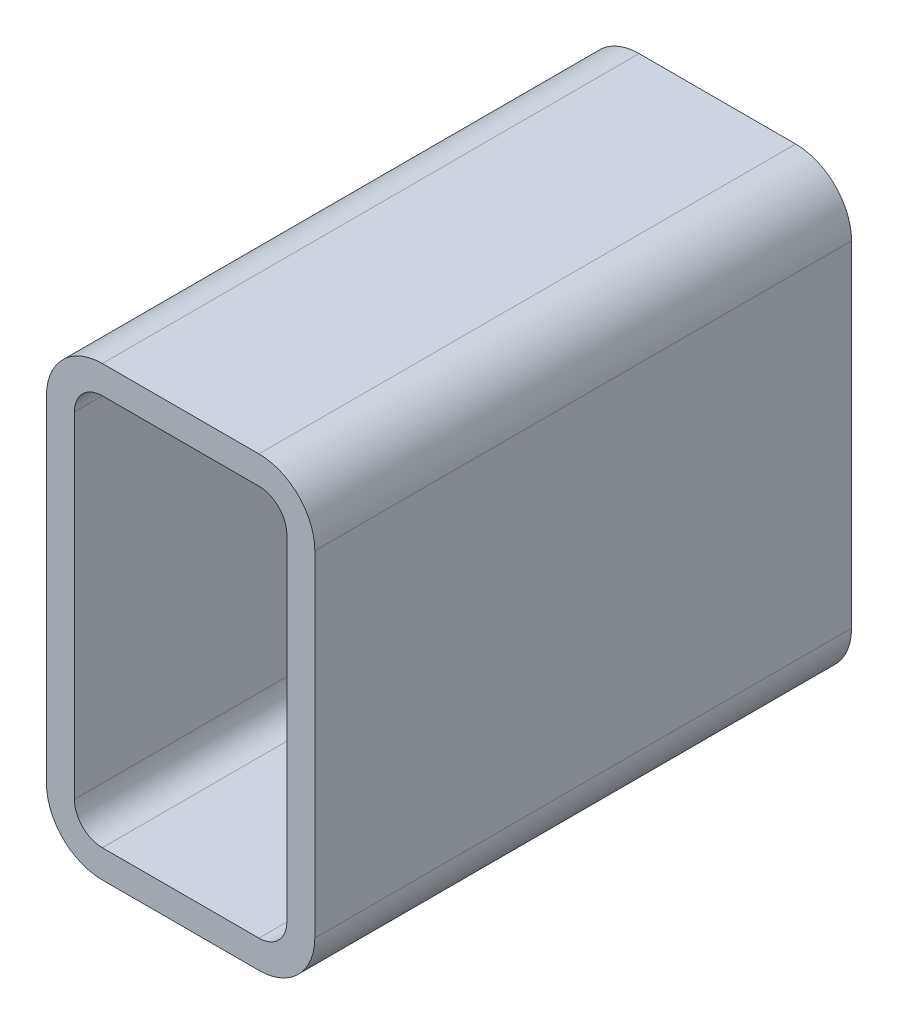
ISO-10303-21;
HEADER;
FILE_DESCRIPTION(('STEP AP214'),'2;1');
FILE_NAME('part.step','',(''),(''),'','','');
FILE_SCHEMA(('AUTOMOTIVE_DESIGN { 1 0 10303 214 1 1 1 1 }'));
ENDSEC;
DATA;
#1=APPLICATION_CONTEXT('core data for automotive mechanical design processes');
#2=APPLICATION_PROTOCOL_DEFINITION('international standard','automotive_design',2000,#1);
#3=PRODUCT_CONTEXT('',#1,'mechanical');
#4=PRODUCT('Part','Part','',(#3));
#5=PRODUCT_RELATED_PRODUCT_CATEGORY('part','',(#4));
#6=PRODUCT_DEFINITION_FORMATION('','',#4);
#7=PRODUCT_DEFINITION_CONTEXT('part definition',#1,'design');
#8=PRODUCT_DEFINITION('design','',#6,#7);
#9=PRODUCT_DEFINITION_SHAPE('','',#8);
#10=(LENGTH_UNIT() NAMED_UNIT(*) SI_UNIT(.MILLI.,.METRE.));
#11=(NAMED_UNIT(*) PLANE_ANGLE_UNIT() SI_UNIT($,.RADIAN.));
#12=(NAMED_UNIT(*) SI_UNIT($,.STERADIAN.) SOLID_ANGLE_UNIT());
#13=UNCERTAINTY_MEASURE_WITH_UNIT(LENGTH_MEASURE(1.E-05),#10,'distance_accuracy_value','');
#14=(GEOMETRIC_REPRESENTATION_CONTEXT(3) GLOBAL_UNCERTAINTY_ASSIGNED_CONTEXT((#13)) GLOBAL_UNIT_ASSIGNED_CONTEXT((#10,
#11,#12)) REPRESENTATION_CONTEXT('',''));
#15=CARTESIAN_POINT('',(0.,0.,0.));
#16=DIRECTION('',(0.,0.,1.));
#17=DIRECTION('',(1.,0.,0.));
#18=AXIS2_PLACEMENT_3D('',#15,#16,#17);
#19=CARTESIAN_POINT('',(31.7973013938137,224.170313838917,304.8));
#20=DIRECTION('',(0.,0.,1.));
#21=DIRECTION('',(1.,0.,0.));
#22=AXIS2_PLACEMENT_3D('',#19,#20,#21);
#23=PLANE('',#22);
#24=CARTESIAN_POINT('',(31.7973013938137,224.170313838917,304.8));
#25=DIRECTION('',(0.,0.,1.));
#26=DIRECTION('',(1.,0.,0.));
#27=AXIS2_PLACEMENT_3D('',#24,#25,#26);
#28=CIRCLE('',#27,31.75);
#29=CARTESIAN_POINT('',(31.7973013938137,255.920313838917,304.8));
#30=VERTEX_POINT('',#29);
#31=CARTESIAN_POINT('',(0.0473013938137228,224.170313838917,304.8));
#32=VERTEX_POINT('',#31);
#33=EDGE_CURVE('E211',#30,#32,#28,.T.);
#34=ORIENTED_EDGE('',*,*,#33,.T.);
#35=DIRECTION('',(0.,-1.,0.));
#36=VECTOR('',#35,1.);
#37=CARTESIAN_POINT('',(0.0473013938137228,33.6703138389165,304.8));
#38=LINE('',#37,#36);
#39=CARTESIAN_POINT('',(0.0473013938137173,33.6703138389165,304.8));
#40=VERTEX_POINT('',#39);
#41=EDGE_CURVE('E214',#32,#40,#38,.T.);
#42=ORIENTED_EDGE('',*,*,#41,.T.);
#43=CARTESIAN_POINT('',(31.7973013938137,33.6703138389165,304.8));
#44=DIRECTION('',(0.,0.,1.));
#45=DIRECTION('',(1.,0.,0.));
#46=AXIS2_PLACEMENT_3D('',#43,#44,#45);
#47=CIRCLE('',#46,31.75);
#48=CARTESIAN_POINT('',(31.7973013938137,1.92031383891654,304.8));
#49=VERTEX_POINT('',#48);
#50=EDGE_CURVE('E217',#40,#49,#47,.T.);
#51=ORIENTED_EDGE('',*,*,#50,.T.);
#52=DIRECTION('',(1.,0.,0.));
#53=VECTOR('',#52,1.);
#54=CARTESIAN_POINT('',(120.697301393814,1.92031383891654,304.8));
#55=LINE('',#54,#53);
#56=CARTESIAN_POINT('',(120.697301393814,1.92031383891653,304.8));
#57=VERTEX_POINT('',#56);
#58=EDGE_CURVE('E219',#49,#57,#55,.T.);
#59=ORIENTED_EDGE('',*,*,#58,.T.);
#60=CARTESIAN_POINT('',(120.697301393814,33.6703138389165,304.8));
#61=DIRECTION('',(0.,0.,1.));
#62=DIRECTION('',(1.,0.,0.));
#63=AXIS2_PLACEMENT_3D('',#60,#61,#62);
#64=CIRCLE('',#63,31.75);
#65=CARTESIAN_POINT('',(152.447301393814,33.6703138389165,304.8));
#66=VERTEX_POINT('',#65);
#67=EDGE_CURVE('E221',#57,#66,#64,.T.);
#68=ORIENTED_EDGE('',*,*,#67,.T.);
#69=DIRECTION('',(0.,1.,0.));
#70=VECTOR('',#69,1.);
#71=CARTESIAN_POINT('',(152.447301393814,224.170313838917,304.8));
#72=LINE('',#71,#70);
#73=CARTESIAN_POINT('',(152.447301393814,224.170313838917,304.8));
#74=VERTEX_POINT('',#73);
#75=EDGE_CURVE('E223',#66,#74,#72,.T.);
#76=ORIENTED_EDGE('',*,*,#75,.T.);
#77=CARTESIAN_POINT('',(120.697301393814,224.170313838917,304.8));
#78=DIRECTION('',(0.,0.,1.));
#79=DIRECTION('',(1.,0.,0.));
#80=AXIS2_PLACEMENT_3D('',#77,#78,#79);
#81=CIRCLE('',#80,31.75);
#82=CARTESIAN_POINT('',(120.697301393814,255.920313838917,304.8));
#83=VERTEX_POINT('',#82);
#84=EDGE_CURVE('E225',#74,#83,#81,.T.);
#85=ORIENTED_EDGE('',*,*,#84,.T.);
#86=DIRECTION('',(-1.,0.,0.));
#87=VECTOR('',#86,1.);
#88=CARTESIAN_POINT('',(31.7973013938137,255.920313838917,304.8));
#89=LINE('',#88,#87);
#90=EDGE_CURVE('E227',#83,#30,#89,.T.);
#91=ORIENTED_EDGE('',*,*,#90,.T.);
#92=EDGE_LOOP('',(#34,#42,#51,#59,#68,#76,#85,#91));
#93=FACE_BOUND('',#92,.T.);
#94=DIRECTION('',(0.,-1.,0.));
#95=VECTOR('',#94,1.);
#96=CARTESIAN_POINT('',(15.9223013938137,33.6703138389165,304.8));
#97=LINE('',#96,#95);
#98=CARTESIAN_POINT('',(15.9223013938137,224.170313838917,304.8));
#99=VERTEX_POINT('',#98);
#100=CARTESIAN_POINT('',(15.9223013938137,33.6703138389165,304.8));
#101=VERTEX_POINT('',#100);
#102=EDGE_CURVE('E154',#99,#101,#97,.T.);
#103=ORIENTED_EDGE('',*,*,#102,.F.);
#104=CARTESIAN_POINT('',(31.7973013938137,224.170313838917,304.8));
#105=DIRECTION('',(0.,0.,1.));
#106=DIRECTION('',(1.,0.,0.));
#107=AXIS2_PLACEMENT_3D('',#104,#105,#106);
#108=CIRCLE('',#107,15.875);
#109=CARTESIAN_POINT('',(31.7973013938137,240.045313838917,304.8));
#110=VERTEX_POINT('',#109);
#111=EDGE_CURVE('E146',#110,#99,#108,.T.);
#112=ORIENTED_EDGE('',*,*,#111,.F.);
#113=DIRECTION('',(-1.,0.,0.));
#114=VECTOR('',#113,1.);
#115=CARTESIAN_POINT('',(31.7973013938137,240.045313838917,304.8));
#116=LINE('',#115,#114);
#117=CARTESIAN_POINT('',(120.697301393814,240.045313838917,304.8));
#118=VERTEX_POINT('',#117);
#119=EDGE_CURVE('E179',#118,#110,#116,.T.);
#120=ORIENTED_EDGE('',*,*,#119,.F.);
#121=CARTESIAN_POINT('',(120.697301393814,224.170313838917,304.8));
#122=DIRECTION('',(0.,0.,1.));
#123=DIRECTION('',(1.,0.,0.));
#124=AXIS2_PLACEMENT_3D('',#121,#122,#123);
#125=CIRCLE('',#124,15.875);
#126=CARTESIAN_POINT('',(136.572301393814,224.170313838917,304.8));
#127=VERTEX_POINT('',#126);
#128=EDGE_CURVE('E177',#127,#118,#125,.T.);
#129=ORIENTED_EDGE('',*,*,#128,.F.);
#130=DIRECTION('',(0.,1.,0.));
#131=VECTOR('',#130,1.);
#132=CARTESIAN_POINT('',(136.572301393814,224.170313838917,304.8));
#133=LINE('',#132,#131);
#134=CARTESIAN_POINT('',(136.572301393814,33.6703138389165,304.8));
#135=VERTEX_POINT('',#134);
#136=EDGE_CURVE('E175',#135,#127,#133,.T.);
#137=ORIENTED_EDGE('',*,*,#136,.F.);
#138=CARTESIAN_POINT('',(120.697301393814,33.6703138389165,304.8));
#139=DIRECTION('',(0.,0.,1.));
#140=DIRECTION('',(1.,0.,0.));
#141=AXIS2_PLACEMENT_3D('',#138,#139,#140);
#142=CIRCLE('',#141,15.875);
#143=CARTESIAN_POINT('',(120.697301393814,17.7953138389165,304.8));
#144=VERTEX_POINT('',#143);
#145=EDGE_CURVE('E173',#144,#135,#142,.T.);
#146=ORIENTED_EDGE('',*,*,#145,.F.);
#147=DIRECTION('',(1.,0.,0.));
#148=VECTOR('',#147,1.);
#149=CARTESIAN_POINT('',(120.697301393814,17.7953138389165,304.8));
#150=LINE('',#149,#148);
#151=CARTESIAN_POINT('',(31.7973013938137,17.7953138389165,304.8));
#152=VERTEX_POINT('',#151);
#153=EDGE_CURVE('E169',#152,#144,#150,.T.);
#154=ORIENTED_EDGE('',*,*,#153,.F.);
#155=CARTESIAN_POINT('',(31.7973013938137,33.6703138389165,304.8));
#156=DIRECTION('',(0.,0.,1.));
#157=DIRECTION('',(1.,0.,0.));
#158=AXIS2_PLACEMENT_3D('',#155,#156,#157);
#159=CIRCLE('',#158,15.875);
#160=EDGE_CURVE('E167',#101,#152,#159,.T.);
#161=ORIENTED_EDGE('',*,*,#160,.F.);
#162=EDGE_LOOP('',(#103,#112,#120,#129,#137,#146,#154,#161));
#163=FACE_BOUND('',#162,.T.);
#164=ADVANCED_FACE('F33',(#93,#163),#23,.T.);
#165=CARTESIAN_POINT('',(31.7973013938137,224.170313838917,0.));
#166=DIRECTION('',(0.,0.,1.));
#167=DIRECTION('',(1.,0.,0.));
#168=AXIS2_PLACEMENT_3D('',#165,#166,#167);
#169=PLANE('',#168);
#170=CARTESIAN_POINT('',(31.7973013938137,224.170313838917,0.));
#171=DIRECTION('',(0.,0.,1.));
#172=DIRECTION('',(1.,0.,0.));
#173=AXIS2_PLACEMENT_3D('',#170,#171,#172);
#174=CIRCLE('',#173,31.75);
#175=CARTESIAN_POINT('',(31.7973013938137,255.920313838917,0.));
#176=VERTEX_POINT('',#175);
#177=CARTESIAN_POINT('',(0.0473013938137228,224.170313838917,0.));
#178=VERTEX_POINT('',#177);
#179=EDGE_CURVE('E162',#176,#178,#174,.T.);
#180=ORIENTED_EDGE('',*,*,#179,.F.);
#181=DIRECTION('',(-1.,0.,0.));
#182=VECTOR('',#181,1.);
#183=CARTESIAN_POINT('',(31.7973013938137,255.920313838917,0.));
#184=LINE('',#183,#182);
#185=CARTESIAN_POINT('',(120.697301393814,255.920313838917,0.));
#186=VERTEX_POINT('',#185);
#187=EDGE_CURVE('E215',#186,#176,#184,.T.);
#188=ORIENTED_EDGE('',*,*,#187,.F.);
#189=CARTESIAN_POINT('',(120.697301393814,224.170313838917,0.));
#190=DIRECTION('',(0.,0.,1.));
#191=DIRECTION('',(1.,0.,0.));
#192=AXIS2_PLACEMENT_3D('',#189,#190,#191);
#193=CIRCLE('',#192,31.75);
#194=CARTESIAN_POINT('',(152.447301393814,224.170313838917,0.));
#195=VERTEX_POINT('',#194);
#196=EDGE_CURVE('E242',#195,#186,#193,.T.);
#197=ORIENTED_EDGE('',*,*,#196,.F.);
#198=DIRECTION('',(0.,1.,0.));
#199=VECTOR('',#198,1.);
#200=CARTESIAN_POINT('',(152.447301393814,224.170313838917,0.));
#201=LINE('',#200,#199);
#202=CARTESIAN_POINT('',(152.447301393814,33.6703138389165,0.));
#203=VERTEX_POINT('',#202);
#204=EDGE_CURVE('E240',#203,#195,#201,.T.);
#205=ORIENTED_EDGE('',*,*,#204,.F.);
#206=CARTESIAN_POINT('',(120.697301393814,33.6703138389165,0.));
#207=DIRECTION('',(0.,0.,1.));
#208=DIRECTION('',(1.,0.,0.));
#209=AXIS2_PLACEMENT_3D('',#206,#207,#208);
#210=CIRCLE('',#209,31.75);
#211=CARTESIAN_POINT('',(120.697301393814,1.92031383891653,0.));
#212=VERTEX_POINT('',#211);
#213=EDGE_CURVE('E238',#212,#203,#210,.T.);
#214=ORIENTED_EDGE('',*,*,#213,.F.);
#215=DIRECTION('',(1.,0.,0.));
#216=VECTOR('',#215,1.);
#217=CARTESIAN_POINT('',(120.697301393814,1.92031383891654,0.));
#218=LINE('',#217,#216);
#219=CARTESIAN_POINT('',(31.7973013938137,1.92031383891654,0.));
#220=VERTEX_POINT('',#219);
#221=EDGE_CURVE('E236',#220,#212,#218,.T.);
#222=ORIENTED_EDGE('',*,*,#221,.F.);
#223=CARTESIAN_POINT('',(31.7973013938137,33.6703138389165,0.));
#224=DIRECTION('',(0.,0.,1.));
#225=DIRECTION('',(1.,0.,0.));
#226=AXIS2_PLACEMENT_3D('',#223,#224,#225);
#227=CIRCLE('',#226,31.75);
#228=CARTESIAN_POINT('',(0.0473013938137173,33.6703138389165,0.));
#229=VERTEX_POINT('',#228);
#230=EDGE_CURVE('E234',#229,#220,#227,.T.);
#231=ORIENTED_EDGE('',*,*,#230,.F.);
#232=DIRECTION('',(0.,-1.,0.));
#233=VECTOR('',#232,1.);
#234=CARTESIAN_POINT('',(0.0473013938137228,33.6703138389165,0.));
#235=LINE('',#234,#233);
#236=EDGE_CURVE('E232',#178,#229,#235,.T.);
#237=ORIENTED_EDGE('',*,*,#236,.F.);
#238=EDGE_LOOP('',(#180,#188,#197,#205,#214,#222,#231,#237));
#239=FACE_BOUND('',#238,.T.);
#240=CARTESIAN_POINT('',(31.7973013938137,224.170313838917,0.));
#241=DIRECTION('',(0.,0.,1.));
#242=DIRECTION('',(1.,0.,0.));
#243=AXIS2_PLACEMENT_3D('',#240,#241,#242);
#244=CIRCLE('',#243,15.875);
#245=CARTESIAN_POINT('',(31.7973013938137,240.045313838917,0.));
#246=VERTEX_POINT('',#245);
#247=CARTESIAN_POINT('',(15.9223013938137,224.170313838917,0.));
#248=VERTEX_POINT('',#247);
#249=EDGE_CURVE('E56',#246,#248,#244,.T.);
#250=ORIENTED_EDGE('',*,*,#249,.T.);
#251=DIRECTION('',(0.,-1.,0.));
#252=VECTOR('',#251,1.);
#253=CARTESIAN_POINT('',(15.9223013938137,33.6703138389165,0.));
#254=LINE('',#253,#252);
#255=CARTESIAN_POINT('',(15.9223013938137,33.6703138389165,0.));
#256=VERTEX_POINT('',#255);
#257=EDGE_CURVE('E161',#248,#256,#254,.T.);
#258=ORIENTED_EDGE('',*,*,#257,.T.);
#259=CARTESIAN_POINT('',(31.7973013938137,33.6703138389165,0.));
#260=DIRECTION('',(0.,0.,1.));
#261=DIRECTION('',(1.,0.,0.));
#262=AXIS2_PLACEMENT_3D('',#259,#260,#261);
#263=CIRCLE('',#262,15.875);
#264=CARTESIAN_POINT('',(31.7973013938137,17.7953138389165,0.));
#265=VERTEX_POINT('',#264);
#266=EDGE_CURVE('E183',#256,#265,#263,.T.);
#267=ORIENTED_EDGE('',*,*,#266,.T.);
#268=DIRECTION('',(1.,0.,0.));
#269=VECTOR('',#268,1.);
#270=CARTESIAN_POINT('',(120.697301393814,17.7953138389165,0.));
#271=LINE('',#270,#269);
#272=CARTESIAN_POINT('',(120.697301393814,17.7953138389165,0.));
#273=VERTEX_POINT('',#272);
#274=EDGE_CURVE('E186',#265,#273,#271,.T.);
#275=ORIENTED_EDGE('',*,*,#274,.T.);
#276=CARTESIAN_POINT('',(120.697301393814,33.6703138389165,0.));
#277=DIRECTION('',(0.,0.,1.));
#278=DIRECTION('',(1.,0.,0.));
#279=AXIS2_PLACEMENT_3D('',#276,#277,#278);
#280=CIRCLE('',#279,15.875);
#281=CARTESIAN_POINT('',(136.572301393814,33.6703138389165,0.));
#282=VERTEX_POINT('',#281);
#283=EDGE_CURVE('E189',#273,#282,#280,.T.);
#284=ORIENTED_EDGE('',*,*,#283,.T.);
#285=DIRECTION('',(0.,1.,0.));
#286=VECTOR('',#285,1.);
#287=CARTESIAN_POINT('',(136.572301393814,224.170313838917,0.));
#288=LINE('',#287,#286);
#289=CARTESIAN_POINT('',(136.572301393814,224.170313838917,0.));
#290=VERTEX_POINT('',#289);
#291=EDGE_CURVE('E192',#282,#290,#288,.T.);
#292=ORIENTED_EDGE('',*,*,#291,.T.);
#293=CARTESIAN_POINT('',(120.697301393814,224.170313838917,0.));
#294=DIRECTION('',(0.,0.,1.));
#295=DIRECTION('',(1.,0.,0.));
#296=AXIS2_PLACEMENT_3D('',#293,#294,#295);
#297=CIRCLE('',#296,15.875);
#298=CARTESIAN_POINT('',(120.697301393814,240.045313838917,0.));
#299=VERTEX_POINT('',#298);
#300=EDGE_CURVE('E195',#290,#299,#297,.T.);
#301=ORIENTED_EDGE('',*,*,#300,.T.);
#302=DIRECTION('',(-1.,0.,0.));
#303=VECTOR('',#302,1.);
#304=CARTESIAN_POINT('',(31.7973013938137,240.045313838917,0.));
#305=LINE('',#304,#303);
#306=EDGE_CURVE('E155',#299,#246,#305,.T.);
#307=ORIENTED_EDGE('',*,*,#306,.T.);
#308=EDGE_LOOP('',(#250,#258,#267,#275,#284,#292,#301,#307));
#309=FACE_BOUND('',#308,.T.);
#310=ADVANCED_FACE('F272',(#239,#309),#169,.F.);
#311=CARTESIAN_POINT('',(31.7973013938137,224.170313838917,304.8));
#312=DIRECTION('',(0.,0.,-1.));
#313=DIRECTION('',(-1.,0.,0.));
#314=AXIS2_PLACEMENT_3D('',#311,#312,#313);
#315=CYLINDRICAL_SURFACE('',#314,31.75);
#316=ORIENTED_EDGE('',*,*,#179,.T.);
#317=DIRECTION('',(0.,0.,-1.));
#318=VECTOR('',#317,1.);
#319=CARTESIAN_POINT('',(0.0473013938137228,224.170313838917,304.8));
#320=LINE('',#319,#318);
#321=EDGE_CURVE('E11',#32,#178,#320,.T.);
#322=ORIENTED_EDGE('',*,*,#321,.F.);
#323=ORIENTED_EDGE('',*,*,#33,.F.);
#324=DIRECTION('',(0.,0.,-1.));
#325=VECTOR('',#324,1.);
#326=CARTESIAN_POINT('',(31.7973013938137,255.920313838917,304.8));
#327=LINE('',#326,#325);
#328=EDGE_CURVE('E229',#30,#176,#327,.T.);
#329=ORIENTED_EDGE('',*,*,#328,.T.);
#330=EDGE_LOOP('',(#316,#322,#323,#329));
#331=FACE_BOUND('',#330,.T.);
#332=ADVANCED_FACE('F35',(#331),#315,.T.);
#333=CARTESIAN_POINT('',(0.0473013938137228,33.6703138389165,304.8));
#334=DIRECTION('',(1.,0.,0.));
#335=DIRECTION('',(0.,0.,-1.));
#336=AXIS2_PLACEMENT_3D('',#333,#334,#335);
#337=PLANE('',#336);
#338=ORIENTED_EDGE('',*,*,#236,.T.);
#339=DIRECTION('',(0.,0.,-1.));
#340=VECTOR('',#339,1.);
#341=CARTESIAN_POINT('',(0.0473013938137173,33.6703138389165,304.8));
#342=LINE('',#341,#340);
#343=EDGE_CURVE('E41',#40,#229,#342,.T.);
#344=ORIENTED_EDGE('',*,*,#343,.F.);
#345=ORIENTED_EDGE('',*,*,#41,.F.);
#346=ORIENTED_EDGE('',*,*,#321,.T.);
#347=EDGE_LOOP('',(#338,#344,#345,#346));
#348=FACE_BOUND('',#347,.T.);
#349=ADVANCED_FACE('F289',(#348),#337,.F.);
#350=CARTESIAN_POINT('',(31.7973013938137,33.6703138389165,304.8));
#351=DIRECTION('',(0.,0.,-1.));
#352=DIRECTION('',(-1.,0.,0.));
#353=AXIS2_PLACEMENT_3D('',#350,#351,#352);
#354=CYLINDRICAL_SURFACE('',#353,31.75);
#355=ORIENTED_EDGE('',*,*,#230,.T.);
#356=DIRECTION('',(0.,0.,-1.));
#357=VECTOR('',#356,1.);
#358=CARTESIAN_POINT('',(31.7973013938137,1.92031383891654,304.8));
#359=LINE('',#358,#357);
#360=EDGE_CURVE('E259',#49,#220,#359,.T.);
#361=ORIENTED_EDGE('',*,*,#360,.F.);
#362=ORIENTED_EDGE('',*,*,#50,.F.);
#363=ORIENTED_EDGE('',*,*,#343,.T.);
#364=EDGE_LOOP('',(#355,#361,#362,#363));
#365=FACE_BOUND('',#364,.T.);
#366=ADVANCED_FACE('F266',(#365),#354,.T.);
#367=CARTESIAN_POINT('',(120.697301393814,1.92031383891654,304.8));
#368=DIRECTION('',(0.,1.,0.));
#369=DIRECTION('',(0.,0.,1.));
#370=AXIS2_PLACEMENT_3D('',#367,#368,#369);
#371=PLANE('',#370);
#372=ORIENTED_EDGE('',*,*,#221,.T.);
#373=DIRECTION('',(0.,0.,-1.));
#374=VECTOR('',#373,1.);
#375=CARTESIAN_POINT('',(120.697301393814,1.92031383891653,304.8));
#376=LINE('',#375,#374);
#377=EDGE_CURVE('E256',#57,#212,#376,.T.);
#378=ORIENTED_EDGE('',*,*,#377,.F.);
#379=ORIENTED_EDGE('',*,*,#58,.F.);
#380=ORIENTED_EDGE('',*,*,#360,.T.);
#381=EDGE_LOOP('',(#372,#378,#379,#380));
#382=FACE_BOUND('',#381,.T.);
#383=ADVANCED_FACE('F278',(#382),#371,.F.);
#384=CARTESIAN_POINT('',(120.697301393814,33.6703138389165,304.8));
#385=DIRECTION('',(0.,0.,-1.));
#386=DIRECTION('',(-1.,0.,0.));
#387=AXIS2_PLACEMENT_3D('',#384,#385,#386);
#388=CYLINDRICAL_SURFACE('',#387,31.75);
#389=ORIENTED_EDGE('',*,*,#213,.T.);
#390=DIRECTION('',(0.,0.,-1.));
#391=VECTOR('',#390,1.);
#392=CARTESIAN_POINT('',(152.447301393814,33.6703138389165,304.8));
#393=LINE('',#392,#391);
#394=EDGE_CURVE('E253',#66,#203,#393,.T.);
#395=ORIENTED_EDGE('',*,*,#394,.F.);
#396=ORIENTED_EDGE('',*,*,#67,.F.);
#397=ORIENTED_EDGE('',*,*,#377,.T.);
#398=EDGE_LOOP('',(#389,#395,#396,#397));
#399=FACE_BOUND('',#398,.T.);
#400=ADVANCED_FACE('F282',(#399),#388,.T.);
#401=CARTESIAN_POINT('',(152.447301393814,224.170313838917,304.8));
#402=DIRECTION('',(-1.,0.,0.));
#403=DIRECTION('',(0.,0.,1.));
#404=AXIS2_PLACEMENT_3D('',#401,#402,#403);
#405=PLANE('',#404);
#406=ORIENTED_EDGE('',*,*,#204,.T.);
#407=DIRECTION('',(0.,0.,-1.));
#408=VECTOR('',#407,1.);
#409=CARTESIAN_POINT('',(152.447301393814,224.170313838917,304.8));
#410=LINE('',#409,#408);
#411=EDGE_CURVE('E250',#74,#195,#410,.T.);
#412=ORIENTED_EDGE('',*,*,#411,.F.);
#413=ORIENTED_EDGE('',*,*,#75,.F.);
#414=ORIENTED_EDGE('',*,*,#394,.T.);
#415=EDGE_LOOP('',(#406,#412,#413,#414));
#416=FACE_BOUND('',#415,.T.);
#417=ADVANCED_FACE('F302',(#416),#405,.F.);
#418=CARTESIAN_POINT('',(120.697301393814,224.170313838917,304.8));
#419=DIRECTION('',(0.,0.,-1.));
#420=DIRECTION('',(-1.,0.,0.));
#421=AXIS2_PLACEMENT_3D('',#418,#419,#420);
#422=CYLINDRICAL_SURFACE('',#421,31.75);
#423=ORIENTED_EDGE('',*,*,#196,.T.);
#424=DIRECTION('',(0.,0.,-1.));
#425=VECTOR('',#424,1.);
#426=CARTESIAN_POINT('',(120.697301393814,255.920313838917,304.8));
#427=LINE('',#426,#425);
#428=EDGE_CURVE('E247',#83,#186,#427,.T.);
#429=ORIENTED_EDGE('',*,*,#428,.F.);
#430=ORIENTED_EDGE('',*,*,#84,.F.);
#431=ORIENTED_EDGE('',*,*,#411,.T.);
#432=EDGE_LOOP('',(#423,#429,#430,#431));
#433=FACE_BOUND('',#432,.T.);
#434=ADVANCED_FACE('F300',(#433),#422,.T.);
#435=CARTESIAN_POINT('',(31.7973013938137,255.920313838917,304.8));
#436=DIRECTION('',(0.,-1.,0.));
#437=DIRECTION('',(0.,0.,-1.));
#438=AXIS2_PLACEMENT_3D('',#435,#436,#437);
#439=PLANE('',#438);
#440=ORIENTED_EDGE('',*,*,#187,.T.);
#441=ORIENTED_EDGE('',*,*,#328,.F.);
#442=ORIENTED_EDGE('',*,*,#90,.F.);
#443=ORIENTED_EDGE('',*,*,#428,.T.);
#444=EDGE_LOOP('',(#440,#441,#442,#443));
#445=FACE_BOUND('',#444,.T.);
#446=ADVANCED_FACE('F295',(#445),#439,.F.);
#447=CARTESIAN_POINT('',(31.7973013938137,224.170313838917,304.8));
#448=DIRECTION('',(0.,0.,-1.));
#449=DIRECTION('',(-1.,0.,0.));
#450=AXIS2_PLACEMENT_3D('',#447,#448,#449);
#451=CYLINDRICAL_SURFACE('',#450,15.875);
#452=ORIENTED_EDGE('',*,*,#249,.F.);
#453=DIRECTION('',(0.,0.,-1.));
#454=VECTOR('',#453,1.);
#455=CARTESIAN_POINT('',(31.7973013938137,240.045313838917,304.8));
#456=LINE('',#455,#454);
#457=EDGE_CURVE('E150',#110,#246,#456,.T.);
#458=ORIENTED_EDGE('',*,*,#457,.F.);
#459=ORIENTED_EDGE('',*,*,#111,.T.);
#460=DIRECTION('',(0.,0.,-1.));
#461=VECTOR('',#460,1.);
#462=CARTESIAN_POINT('',(15.9223013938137,224.170313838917,304.8));
#463=LINE('',#462,#461);
#464=EDGE_CURVE('E149',#99,#248,#463,.T.);
#465=ORIENTED_EDGE('',*,*,#464,.T.);
#466=EDGE_LOOP('',(#452,#458,#459,#465));
#467=FACE_BOUND('',#466,.T.);
#468=ADVANCED_FACE('F148',(#467),#451,.F.);
#469=CARTESIAN_POINT('',(15.9223013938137,33.6703138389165,304.8));
#470=DIRECTION('',(1.,0.,0.));
#471=DIRECTION('',(0.,0.,-1.));
#472=AXIS2_PLACEMENT_3D('',#469,#470,#471);
#473=PLANE('',#472);
#474=ORIENTED_EDGE('',*,*,#257,.F.);
#475=ORIENTED_EDGE('',*,*,#464,.F.);
#476=ORIENTED_EDGE('',*,*,#102,.T.);
#477=DIRECTION('',(0.,0.,-1.));
#478=VECTOR('',#477,1.);
#479=CARTESIAN_POINT('',(15.9223013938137,33.6703138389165,304.8));
#480=LINE('',#479,#478);
#481=EDGE_CURVE('E163',#101,#256,#480,.T.);
#482=ORIENTED_EDGE('',*,*,#481,.T.);
#483=EDGE_LOOP('',(#474,#475,#476,#482));
#484=FACE_BOUND('',#483,.T.);
#485=ADVANCED_FACE('F158',(#484),#473,.T.);
#486=CARTESIAN_POINT('',(31.7973013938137,33.6703138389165,304.8));
#487=DIRECTION('',(0.,0.,-1.));
#488=DIRECTION('',(-1.,0.,0.));
#489=AXIS2_PLACEMENT_3D('',#486,#487,#488);
#490=CYLINDRICAL_SURFACE('',#489,15.875);
#491=ORIENTED_EDGE('',*,*,#266,.F.);
#492=ORIENTED_EDGE('',*,*,#481,.F.);
#493=ORIENTED_EDGE('',*,*,#160,.T.);
#494=DIRECTION('',(0.,0.,-1.));
#495=VECTOR('',#494,1.);
#496=CARTESIAN_POINT('',(31.7973013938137,17.7953138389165,304.8));
#497=LINE('',#496,#495);
#498=EDGE_CURVE('E208',#152,#265,#497,.T.);
#499=ORIENTED_EDGE('',*,*,#498,.T.);
#500=EDGE_LOOP('',(#491,#492,#493,#499));
#501=FACE_BOUND('',#500,.T.);
#502=ADVANCED_FACE('F327',(#501),#490,.F.);
#503=CARTESIAN_POINT('',(120.697301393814,17.7953138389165,304.8));
#504=DIRECTION('',(0.,1.,0.));
#505=DIRECTION('',(0.,0.,1.));
#506=AXIS2_PLACEMENT_3D('',#503,#504,#505);
#507=PLANE('',#506);
#508=ORIENTED_EDGE('',*,*,#274,.F.);
#509=ORIENTED_EDGE('',*,*,#498,.F.);
#510=ORIENTED_EDGE('',*,*,#153,.T.);
#511=DIRECTION('',(0.,0.,-1.));
#512=VECTOR('',#511,1.);
#513=CARTESIAN_POINT('',(120.697301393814,17.7953138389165,304.8));
#514=LINE('',#513,#512);
#515=EDGE_CURVE('E206',#144,#273,#514,.T.);
#516=ORIENTED_EDGE('',*,*,#515,.T.);
#517=EDGE_LOOP('',(#508,#509,#510,#516));
#518=FACE_BOUND('',#517,.T.);
#519=ADVANCED_FACE('F331',(#518),#507,.T.);
#520=CARTESIAN_POINT('',(120.697301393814,33.6703138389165,304.8));
#521=DIRECTION('',(0.,0.,-1.));
#522=DIRECTION('',(-1.,0.,0.));
#523=AXIS2_PLACEMENT_3D('',#520,#521,#522);
#524=CYLINDRICAL_SURFACE('',#523,15.875);
#525=ORIENTED_EDGE('',*,*,#283,.F.);
#526=ORIENTED_EDGE('',*,*,#515,.F.);
#527=ORIENTED_EDGE('',*,*,#145,.T.);
#528=DIRECTION('',(0.,0.,-1.));
#529=VECTOR('',#528,1.);
#530=CARTESIAN_POINT('',(136.572301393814,33.6703138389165,304.8));
#531=LINE('',#530,#529);
#532=EDGE_CURVE('E204',#135,#282,#531,.T.);
#533=ORIENTED_EDGE('',*,*,#532,.T.);
#534=EDGE_LOOP('',(#525,#526,#527,#533));
#535=FACE_BOUND('',#534,.T.);
#536=ADVANCED_FACE('F337',(#535),#524,.F.);
#537=CARTESIAN_POINT('',(136.572301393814,224.170313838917,304.8));
#538=DIRECTION('',(-1.,0.,0.));
#539=DIRECTION('',(0.,0.,1.));
#540=AXIS2_PLACEMENT_3D('',#537,#538,#539);
#541=PLANE('',#540);
#542=ORIENTED_EDGE('',*,*,#291,.F.);
#543=ORIENTED_EDGE('',*,*,#532,.F.);
#544=ORIENTED_EDGE('',*,*,#136,.T.);
#545=DIRECTION('',(0.,0.,-1.));
#546=VECTOR('',#545,1.);
#547=CARTESIAN_POINT('',(136.572301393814,224.170313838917,304.8));
#548=LINE('',#547,#546);
#549=EDGE_CURVE('E202',#127,#290,#548,.T.);
#550=ORIENTED_EDGE('',*,*,#549,.T.);
#551=EDGE_LOOP('',(#542,#543,#544,#550));
#552=FACE_BOUND('',#551,.T.);
#553=ADVANCED_FACE('F341',(#552),#541,.T.);
#554=CARTESIAN_POINT('',(120.697301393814,224.170313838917,304.8));
#555=DIRECTION('',(0.,0.,-1.));
#556=DIRECTION('',(-1.,0.,0.));
#557=AXIS2_PLACEMENT_3D('',#554,#555,#556);
#558=CYLINDRICAL_SURFACE('',#557,15.875);
#559=ORIENTED_EDGE('',*,*,#300,.F.);
#560=ORIENTED_EDGE('',*,*,#549,.F.);
#561=ORIENTED_EDGE('',*,*,#128,.T.);
#562=DIRECTION('',(0.,0.,-1.));
#563=VECTOR('',#562,1.);
#564=CARTESIAN_POINT('',(120.697301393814,240.045313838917,304.8));
#565=LINE('',#564,#563);
#566=EDGE_CURVE('E48',#118,#299,#565,.T.);
#567=ORIENTED_EDGE('',*,*,#566,.T.);
#568=EDGE_LOOP('',(#559,#560,#561,#567));
#569=FACE_BOUND('',#568,.T.);
#570=ADVANCED_FACE('F345',(#569),#558,.F.);
#571=CARTESIAN_POINT('',(31.7973013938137,240.045313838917,304.8));
#572=DIRECTION('',(0.,-1.,0.));
#573=DIRECTION('',(0.,0.,-1.));
#574=AXIS2_PLACEMENT_3D('',#571,#572,#573);
#575=PLANE('',#574);
#576=ORIENTED_EDGE('',*,*,#306,.F.);
#577=ORIENTED_EDGE('',*,*,#566,.F.);
#578=ORIENTED_EDGE('',*,*,#119,.T.);
#579=ORIENTED_EDGE('',*,*,#457,.T.);
#580=EDGE_LOOP('',(#576,#577,#578,#579));
#581=FACE_BOUND('',#580,.T.);
#582=ADVANCED_FACE('F349',(#581),#575,.T.);
#583=CLOSED_SHELL('',(#164,#310,#332,#349,#366,#383,#400,#417,#434,#446,#468,#485,#502,#519,
#536,#553,#570,#582));
#584=MANIFOLD_SOLID_BREP('B2',#583);
#585=ADVANCED_BREP_SHAPE_REPRESENTATION('',(#18,#584),#14);
#586=SHAPE_DEFINITION_REPRESENTATION(#9,#585);
ENDSEC;
END-ISO-10303-21;
